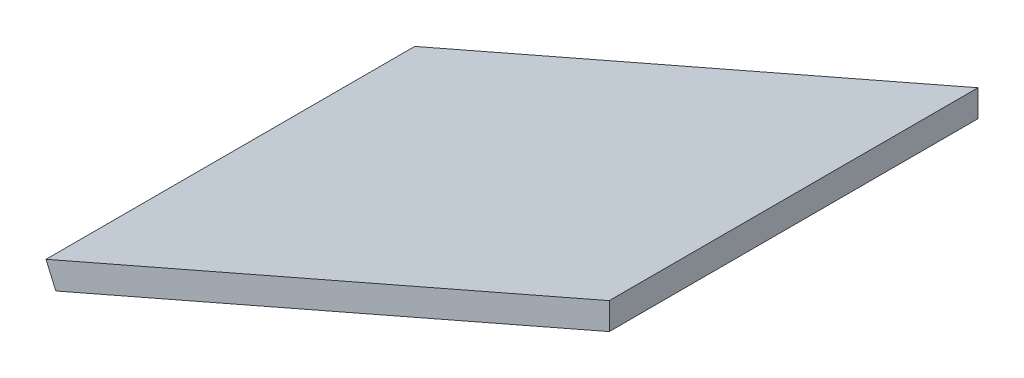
from build123d import *

# Parameters (mm, degrees)
RESSALTO_EXTRUS_O1_DEPTH = 30


with BuildPart() as part:
    # Esbo_o1 → Ressalto-extrus_o1 (new body)
    with BuildSketch(Plane.XY):
        Polygon((22.112878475, 9.650851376), (-22.912878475, -10), (-23.712878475, -8.166969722), (22.112878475, 11.833030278), align=None)
    extrude(amount=RESSALTO_EXTRUS_O1_DEPTH)


solid = part.part
